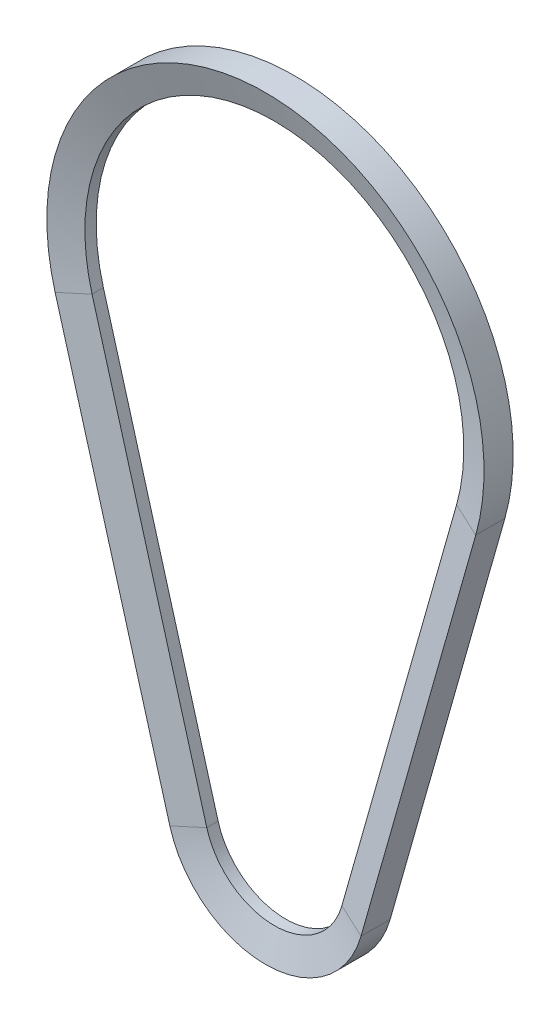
from build123d import *


with BuildPart() as part:
    # Balayage1: sweep along a path in Esquisse1
    with BuildLine(Plane.XY) as balayage1_path:
        Line((-79.372539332, -22.5), (-36.078426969, -175.227272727))
        ThreePointArc((-36.078426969, -175.227272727), (0, -202.5), (36.078426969, -175.227272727))
        Line((36.078426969, -175.227272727), (79.372539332, -22.5))
        ThreePointArc((79.372539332, -22.5), (0, 82.5), (-79.372539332, -22.5))
    # Esquisse3 → Balayage1 (sweep)
    with BuildSketch(Plane(origin=(0, 0, 0), x_dir=(0, 0, -1), z_dir=(1, 0, 0))):
        Polygon((0, 82.5), (5.5, 82.5), (2.136962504, 71.5), (-2.136962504, 71.5), (-5.5, 82.5), align=None)
    sweep(path=balayage1_path.line)


solid = part.part
